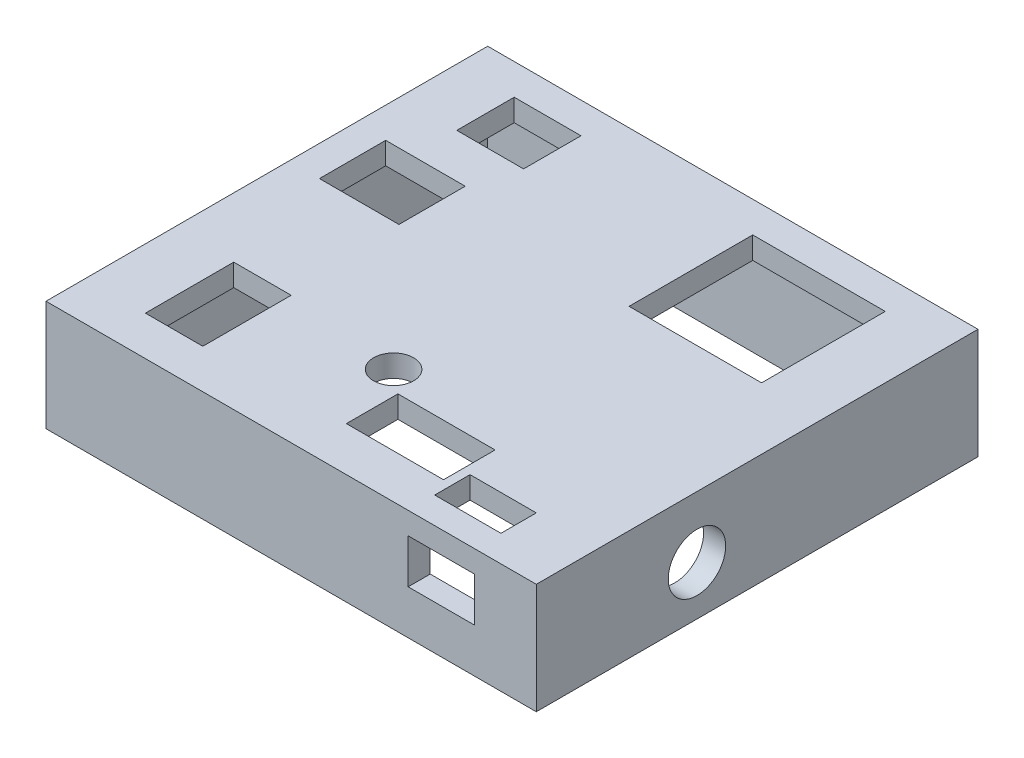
ISO-10303-21;
HEADER;
FILE_DESCRIPTION(('STEP AP214'),'2;1');
FILE_NAME('part.step','',(''),(''),'','','');
FILE_SCHEMA(('AUTOMOTIVE_DESIGN { 1 0 10303 214 1 1 1 1 }'));
ENDSEC;
DATA;
#1=APPLICATION_CONTEXT('core data for automotive mechanical design processes');
#2=APPLICATION_PROTOCOL_DEFINITION('international standard','automotive_design',2000,#1);
#3=PRODUCT_CONTEXT('',#1,'mechanical');
#4=PRODUCT('Part','Part','',(#3));
#5=PRODUCT_RELATED_PRODUCT_CATEGORY('part','',(#4));
#6=PRODUCT_DEFINITION_FORMATION('','',#4);
#7=PRODUCT_DEFINITION_CONTEXT('part definition',#1,'design');
#8=PRODUCT_DEFINITION('design','',#6,#7);
#9=PRODUCT_DEFINITION_SHAPE('','',#8);
#10=(LENGTH_UNIT() NAMED_UNIT(*) SI_UNIT(.MILLI.,.METRE.));
#11=(NAMED_UNIT(*) PLANE_ANGLE_UNIT() SI_UNIT($,.RADIAN.));
#12=(NAMED_UNIT(*) SI_UNIT($,.STERADIAN.) SOLID_ANGLE_UNIT());
#13=UNCERTAINTY_MEASURE_WITH_UNIT(LENGTH_MEASURE(1.E-05),#10,'distance_accuracy_value','');
#14=(GEOMETRIC_REPRESENTATION_CONTEXT(3) GLOBAL_UNCERTAINTY_ASSIGNED_CONTEXT((#13)) GLOBAL_UNIT_ASSIGNED_CONTEXT((#10,
#11,#12)) REPRESENTATION_CONTEXT('',''));
#15=CARTESIAN_POINT('',(0.,0.,0.));
#16=DIRECTION('',(0.,0.,1.));
#17=DIRECTION('',(1.,0.,0.));
#18=AXIS2_PLACEMENT_3D('',#15,#16,#17);
#19=CARTESIAN_POINT('',(0.,25.,0.));
#20=DIRECTION('',(0.,-1.,0.));
#21=DIRECTION('',(0.,0.,-1.));
#22=AXIS2_PLACEMENT_3D('',#19,#20,#21);
#23=PLANE('',#22);
#24=DIRECTION('',(0.,0.,-1.));
#25=VECTOR('',#24,1.);
#26=CARTESIAN_POINT('',(-0.848341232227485,25.,0.));
#27=LINE('',#26,#25);
#28=CARTESIAN_POINT('',(-0.848341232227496,25.,52.1303317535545));
#29=VERTEX_POINT('',#28);
#30=CARTESIAN_POINT('',(-0.848341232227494,25.,44.1303317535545));
#31=VERTEX_POINT('',#30);
#32=EDGE_CURVE('E467',#29,#31,#27,.T.);
#33=ORIENTED_EDGE('',*,*,#32,.F.);
#34=DIRECTION('',(-1.,0.,0.));
#35=VECTOR('',#34,1.);
#36=CARTESIAN_POINT('',(0.,25.,52.1303317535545));
#37=LINE('',#36,#35);
#38=CARTESIAN_POINT('',(-15.8483412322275,25.,52.1303317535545));
#39=VERTEX_POINT('',#38);
#40=EDGE_CURVE('E459',#29,#39,#37,.T.);
#41=ORIENTED_EDGE('',*,*,#40,.T.);
#42=DIRECTION('',(0.,0.,-1.));
#43=VECTOR('',#42,1.);
#44=CARTESIAN_POINT('',(-15.8483412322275,25.,0.));
#45=LINE('',#44,#43);
#46=CARTESIAN_POINT('',(-15.8483412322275,25.,44.1303317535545));
#47=VERTEX_POINT('',#46);
#48=EDGE_CURVE('E462',#39,#47,#45,.T.);
#49=ORIENTED_EDGE('',*,*,#48,.T.);
#50=DIRECTION('',(-1.,0.,0.));
#51=VECTOR('',#50,1.);
#52=CARTESIAN_POINT('',(0.,25.,44.1303317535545));
#53=LINE('',#52,#51);
#54=EDGE_CURVE('E465',#31,#47,#53,.T.);
#55=ORIENTED_EDGE('',*,*,#54,.F.);
#56=EDGE_LOOP('',(#33,#41,#49,#55));
#57=FACE_BOUND('',#56,.T.);
#58=DIRECTION('',(1.,0.,0.));
#59=VECTOR('',#58,1.);
#60=CARTESIAN_POINT('',(0.,25.,36.4578858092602));
#61=LINE('',#60,#59);
#62=CARTESIAN_POINT('',(-39.8483412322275,25.,36.4578858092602));
#63=VERTEX_POINT('',#62);
#64=CARTESIAN_POINT('',(-17.8483412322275,25.,36.4578858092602));
#65=VERTEX_POINT('',#64);
#66=EDGE_CURVE('E495',#63,#65,#61,.T.);
#67=ORIENTED_EDGE('',*,*,#66,.T.);
#68=DIRECTION('',(0.,0.,1.));
#69=VECTOR('',#68,1.);
#70=CARTESIAN_POINT('',(-17.8483412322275,25.,0.));
#71=LINE('',#70,#69);
#72=CARTESIAN_POINT('',(-17.8483412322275,25.,48.1303317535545));
#73=VERTEX_POINT('',#72);
#74=EDGE_CURVE('E498',#65,#73,#71,.T.);
#75=ORIENTED_EDGE('',*,*,#74,.T.);
#76=DIRECTION('',(-1.,0.,0.));
#77=VECTOR('',#76,1.);
#78=CARTESIAN_POINT('',(0.,25.,48.1303317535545));
#79=LINE('',#78,#77);
#80=CARTESIAN_POINT('',(-39.8483412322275,25.,48.1303317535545));
#81=VERTEX_POINT('',#80);
#82=EDGE_CURVE('E483',#73,#81,#79,.T.);
#83=ORIENTED_EDGE('',*,*,#82,.T.);
#84=DIRECTION('',(0.,0.,-1.));
#85=VECTOR('',#84,1.);
#86=CARTESIAN_POINT('',(-39.8483412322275,25.,0.));
#87=LINE('',#86,#85);
#88=EDGE_CURVE('E492',#81,#63,#87,.T.);
#89=ORIENTED_EDGE('',*,*,#88,.T.);
#90=EDGE_LOOP('',(#67,#75,#83,#89));
#91=FACE_BOUND('',#90,.T.);
#92=DIRECTION('',(1.,0.,0.));
#93=VECTOR('',#92,1.);
#94=CARTESIAN_POINT('',(-97.8483412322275,25.,-41.8696682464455));
#95=LINE('',#94,#93);
#96=CARTESIAN_POINT('',(-97.8483412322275,25.,-41.8696682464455));
#97=VERTEX_POINT('',#96);
#98=CARTESIAN_POINT('',(13.1516587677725,25.,-41.8696682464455));
#99=VERTEX_POINT('',#98);
#100=EDGE_CURVE('E534',#97,#99,#95,.T.);
#101=ORIENTED_EDGE('',*,*,#100,.F.);
#102=DIRECTION('',(0.,0.,1.));
#103=VECTOR('',#102,1.);
#104=CARTESIAN_POINT('',(-97.8483412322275,25.,-41.8696682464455));
#105=LINE('',#104,#103);
#106=CARTESIAN_POINT('',(-97.8483412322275,25.,58.1303317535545));
#107=VERTEX_POINT('',#106);
#108=EDGE_CURVE('E543',#97,#107,#105,.T.);
#109=ORIENTED_EDGE('',*,*,#108,.T.);
#110=DIRECTION('',(1.,0.,0.));
#111=VECTOR('',#110,1.);
#112=CARTESIAN_POINT('',(-97.8483412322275,25.,58.1303317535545));
#113=LINE('',#112,#111);
#114=CARTESIAN_POINT('',(13.1516587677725,25.,58.1303317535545));
#115=VERTEX_POINT('',#114);
#116=EDGE_CURVE('E541',#107,#115,#113,.T.);
#117=ORIENTED_EDGE('',*,*,#116,.T.);
#118=DIRECTION('',(0.,0.,1.));
#119=VECTOR('',#118,1.);
#120=CARTESIAN_POINT('',(13.1516587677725,25.,-41.8696682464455));
#121=LINE('',#120,#119);
#122=EDGE_CURVE('E537',#99,#115,#121,.T.);
#123=ORIENTED_EDGE('',*,*,#122,.F.);
#124=EDGE_LOOP('',(#101,#109,#117,#123));
#125=FACE_BOUND('',#124,.T.);
#126=DIRECTION('',(-1.,0.,0.));
#127=VECTOR('',#126,1.);
#128=CARTESIAN_POINT('',(0.,25.,3.13033175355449));
#129=LINE('',#128,#127);
#130=CARTESIAN_POINT('',(-72.9405315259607,25.,3.13033175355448));
#131=VERTEX_POINT('',#130);
#132=CARTESIAN_POINT('',(-90.9405315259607,25.,3.13033175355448));
#133=VERTEX_POINT('',#132);
#134=EDGE_CURVE('E432',#131,#133,#129,.T.);
#135=ORIENTED_EDGE('',*,*,#134,.T.);
#136=DIRECTION('',(0.,0.,-1.));
#137=VECTOR('',#136,1.);
#138=CARTESIAN_POINT('',(-90.9405315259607,25.,0.));
#139=LINE('',#138,#137);
#140=CARTESIAN_POINT('',(-90.9405315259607,25.,-11.8696682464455));
#141=VERTEX_POINT('',#140);
#142=EDGE_CURVE('E435',#133,#141,#139,.T.);
#143=ORIENTED_EDGE('',*,*,#142,.T.);
#144=DIRECTION('',(1.,0.,0.));
#145=VECTOR('',#144,1.);
#146=CARTESIAN_POINT('',(0.,25.,-11.8696682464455));
#147=LINE('',#146,#145);
#148=CARTESIAN_POINT('',(-72.9405315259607,25.,-11.8696682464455));
#149=VERTEX_POINT('',#148);
#150=EDGE_CURVE('E420',#141,#149,#147,.T.);
#151=ORIENTED_EDGE('',*,*,#150,.T.);
#152=DIRECTION('',(0.,0.,1.));
#153=VECTOR('',#152,1.);
#154=CARTESIAN_POINT('',(-72.9405315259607,25.,0.));
#155=LINE('',#154,#153);
#156=EDGE_CURVE('E429',#149,#131,#155,.T.);
#157=ORIENTED_EDGE('',*,*,#156,.T.);
#158=EDGE_LOOP('',(#135,#143,#151,#157));
#159=FACE_BOUND('',#158,.T.);
#160=DIRECTION('',(-1.,0.,0.));
#161=VECTOR('',#160,1.);
#162=CARTESIAN_POINT('',(0.,25.,-21.8696682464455));
#163=LINE('',#162,#161);
#164=CARTESIAN_POINT('',(-69.72707071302,25.,-21.8696682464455));
#165=VERTEX_POINT('',#164);
#166=CARTESIAN_POINT('',(-84.8483412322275,25.,-21.8696682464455));
#167=VERTEX_POINT('',#166);
#168=EDGE_CURVE('E400',#165,#167,#163,.T.);
#169=ORIENTED_EDGE('',*,*,#168,.T.);
#170=DIRECTION('',(0.,0.,-1.));
#171=VECTOR('',#170,1.);
#172=CARTESIAN_POINT('',(-84.8483412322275,25.,0.));
#173=LINE('',#172,#171);
#174=CARTESIAN_POINT('',(-84.8483412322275,25.,-34.8696682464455));
#175=VERTEX_POINT('',#174);
#176=EDGE_CURVE('E403',#167,#175,#173,.T.);
#177=ORIENTED_EDGE('',*,*,#176,.T.);
#178=DIRECTION('',(1.,0.,0.));
#179=VECTOR('',#178,1.);
#180=CARTESIAN_POINT('',(0.,25.,-34.8696682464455));
#181=LINE('',#180,#179);
#182=CARTESIAN_POINT('',(-69.72707071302,25.,-34.8696682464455));
#183=VERTEX_POINT('',#182);
#184=EDGE_CURVE('E388',#175,#183,#181,.T.);
#185=ORIENTED_EDGE('',*,*,#184,.T.);
#186=DIRECTION('',(0.,0.,1.));
#187=VECTOR('',#186,1.);
#188=CARTESIAN_POINT('',(-69.72707071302,25.,0.));
#189=LINE('',#188,#187);
#190=EDGE_CURVE('E397',#183,#165,#189,.T.);
#191=ORIENTED_EDGE('',*,*,#190,.T.);
#192=EDGE_LOOP('',(#169,#177,#185,#191));
#193=FACE_BOUND('',#192,.T.);
#194=DIRECTION('',(1.,0.,0.));
#195=VECTOR('',#194,1.);
#196=CARTESIAN_POINT('',(0.,25.,-34.8696682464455));
#197=LINE('',#196,#195);
#198=CARTESIAN_POINT('',(-30.8483412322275,25.,-34.8696682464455));
#199=VERTEX_POINT('',#198);
#200=CARTESIAN_POINT('',(-0.848341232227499,25.,-34.8696682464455));
#201=VERTEX_POINT('',#200);
#202=EDGE_CURVE('E368',#199,#201,#197,.T.);
#203=ORIENTED_EDGE('',*,*,#202,.T.);
#204=DIRECTION('',(0.,0.,1.));
#205=VECTOR('',#204,1.);
#206=CARTESIAN_POINT('',(-0.848341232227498,25.,0.));
#207=LINE('',#206,#205);
#208=CARTESIAN_POINT('',(-0.848341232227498,25.,-6.86966824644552));
#209=VERTEX_POINT('',#208);
#210=EDGE_CURVE('E371',#201,#209,#207,.T.);
#211=ORIENTED_EDGE('',*,*,#210,.T.);
#212=DIRECTION('',(-1.,0.,0.));
#213=VECTOR('',#212,1.);
#214=CARTESIAN_POINT('',(0.,25.,-6.86966824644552));
#215=LINE('',#214,#213);
#216=CARTESIAN_POINT('',(-30.8483412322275,25.,-6.86966824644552));
#217=VERTEX_POINT('',#216);
#218=EDGE_CURVE('E356',#209,#217,#215,.T.);
#219=ORIENTED_EDGE('',*,*,#218,.T.);
#220=DIRECTION('',(0.,0.,-1.));
#221=VECTOR('',#220,1.);
#222=CARTESIAN_POINT('',(-30.8483412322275,25.,0.));
#223=LINE('',#222,#221);
#224=EDGE_CURVE('E365',#217,#199,#223,.T.);
#225=ORIENTED_EDGE('',*,*,#224,.T.);
#226=EDGE_LOOP('',(#203,#211,#219,#225));
#227=FACE_BOUND('',#226,.T.);
#228=CARTESIAN_POINT('',(-45.1557478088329,25.,32.1303317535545));
#229=DIRECTION('',(0.,-1.,0.));
#230=DIRECTION('',(0.,0.,-1.));
#231=AXIS2_PLACEMENT_3D('',#228,#229,#230);
#232=CIRCLE('',#231,4.53368400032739);
#233=CARTESIAN_POINT('',(-45.1557478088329,25.,27.5966477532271));
#234=VERTEX_POINT('',#233);
#235=EDGE_CURVE('E339',#234,#234,#232,.T.);
#236=ORIENTED_EDGE('',*,*,#235,.T.);
#237=EDGE_LOOP('',(#236));
#238=FACE_BOUND('',#237,.T.);
#239=DIRECTION('',(1.,0.,0.));
#240=VECTOR('',#239,1.);
#241=CARTESIAN_POINT('',(0.,25.,49.2145306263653));
#242=LINE('',#241,#240);
#243=CARTESIAN_POINT('',(-84.2612879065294,25.,49.2145306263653));
#244=VERTEX_POINT('',#243);
#245=CARTESIAN_POINT('',(-71.2612879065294,25.,49.2145306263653));
#246=VERTEX_POINT('',#245);
#247=EDGE_CURVE('E334',#244,#246,#242,.T.);
#248=ORIENTED_EDGE('',*,*,#247,.F.);
#249=DIRECTION('',(0.,0.,-1.));
#250=VECTOR('',#249,1.);
#251=CARTESIAN_POINT('',(-84.2612879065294,25.,0.));
#252=LINE('',#251,#250);
#253=CARTESIAN_POINT('',(-84.2612879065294,25.,29.2145306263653));
#254=VERTEX_POINT('',#253);
#255=EDGE_CURVE('E326',#244,#254,#252,.T.);
#256=ORIENTED_EDGE('',*,*,#255,.T.);
#257=DIRECTION('',(1.,0.,0.));
#258=VECTOR('',#257,1.);
#259=CARTESIAN_POINT('',(0.,25.,29.2145306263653));
#260=LINE('',#259,#258);
#261=CARTESIAN_POINT('',(-71.2612879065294,25.,29.2145306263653));
#262=VERTEX_POINT('',#261);
#263=EDGE_CURVE('E329',#254,#262,#260,.T.);
#264=ORIENTED_EDGE('',*,*,#263,.T.);
#265=DIRECTION('',(0.,0.,-1.));
#266=VECTOR('',#265,1.);
#267=CARTESIAN_POINT('',(-71.2612879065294,25.,0.));
#268=LINE('',#267,#266);
#269=EDGE_CURVE('E332',#246,#262,#268,.T.);
#270=ORIENTED_EDGE('',*,*,#269,.F.);
#271=EDGE_LOOP('',(#248,#256,#264,#270));
#272=FACE_BOUND('',#271,.T.);
#273=ADVANCED_FACE('F33',(#57,#91,#125,#159,#193,#227,#238,#272),#23,.F.);
#274=CARTESIAN_POINT('',(0.,20.,0.));
#275=DIRECTION('',(0.,-1.,0.));
#276=DIRECTION('',(0.,0.,-1.));
#277=AXIS2_PLACEMENT_3D('',#274,#275,#276);
#278=PLANE('',#277);
#279=CARTESIAN_POINT('',(-45.1557478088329,20.,32.1303317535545));
#280=DIRECTION('',(0.,-1.,0.));
#281=DIRECTION('',(0.,0.,-1.));
#282=AXIS2_PLACEMENT_3D('',#279,#280,#281);
#283=CIRCLE('',#282,4.53368400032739);
#284=CARTESIAN_POINT('',(-45.1557478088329,20.,27.5966477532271));
#285=VERTEX_POINT('',#284);
#286=EDGE_CURVE('E336',#285,#285,#283,.T.);
#287=ORIENTED_EDGE('',*,*,#286,.F.);
#288=EDGE_LOOP('',(#287));
#289=FACE_BOUND('',#288,.T.);
#290=DIRECTION('',(0.,0.,1.));
#291=VECTOR('',#290,1.);
#292=CARTESIAN_POINT('',(-0.848341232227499,20.,-34.8696682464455));
#293=LINE('',#292,#291);
#294=CARTESIAN_POINT('',(-0.848341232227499,20.,-34.8696682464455));
#295=VERTEX_POINT('',#294);
#296=CARTESIAN_POINT('',(-0.848341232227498,20.,-6.86966824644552));
#297=VERTEX_POINT('',#296);
#298=EDGE_CURVE('E342',#295,#297,#293,.T.);
#299=ORIENTED_EDGE('',*,*,#298,.F.);
#300=DIRECTION('',(1.,0.,0.));
#301=VECTOR('',#300,1.);
#302=CARTESIAN_POINT('',(-0.848341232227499,20.,-34.8696682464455));
#303=LINE('',#302,#301);
#304=CARTESIAN_POINT('',(-30.8483412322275,20.,-34.8696682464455));
#305=VERTEX_POINT('',#304);
#306=EDGE_CURVE('E350',#305,#295,#303,.T.);
#307=ORIENTED_EDGE('',*,*,#306,.F.);
#308=DIRECTION('',(0.,0.,-1.));
#309=VECTOR('',#308,1.);
#310=CARTESIAN_POINT('',(-30.8483412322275,20.,-34.8696682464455));
#311=LINE('',#310,#309);
#312=CARTESIAN_POINT('',(-30.8483412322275,20.,-6.86966824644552));
#313=VERTEX_POINT('',#312);
#314=EDGE_CURVE('E347',#313,#305,#311,.T.);
#315=ORIENTED_EDGE('',*,*,#314,.F.);
#316=DIRECTION('',(-1.,0.,0.));
#317=VECTOR('',#316,1.);
#318=CARTESIAN_POINT('',(-0.848341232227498,20.,-6.86966824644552));
#319=LINE('',#318,#317);
#320=EDGE_CURVE('E344',#297,#313,#319,.T.);
#321=ORIENTED_EDGE('',*,*,#320,.F.);
#322=EDGE_LOOP('',(#299,#307,#315,#321));
#323=FACE_BOUND('',#322,.T.);
#324=DIRECTION('',(0.,0.,-1.));
#325=VECTOR('',#324,1.);
#326=CARTESIAN_POINT('',(-84.8483412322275,20.,-34.8696682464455));
#327=LINE('',#326,#325);
#328=CARTESIAN_POINT('',(-84.8483412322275,20.,-21.8696682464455));
#329=VERTEX_POINT('',#328);
#330=CARTESIAN_POINT('',(-84.8483412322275,20.,-34.8696682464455));
#331=VERTEX_POINT('',#330);
#332=EDGE_CURVE('E374',#329,#331,#327,.T.);
#333=ORIENTED_EDGE('',*,*,#332,.F.);
#334=DIRECTION('',(-1.,0.,0.));
#335=VECTOR('',#334,1.);
#336=CARTESIAN_POINT('',(-84.8483412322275,20.,-21.8696682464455));
#337=LINE('',#336,#335);
#338=CARTESIAN_POINT('',(-69.72707071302,20.,-21.8696682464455));
#339=VERTEX_POINT('',#338);
#340=EDGE_CURVE('E382',#339,#329,#337,.T.);
#341=ORIENTED_EDGE('',*,*,#340,.F.);
#342=DIRECTION('',(0.,0.,1.));
#343=VECTOR('',#342,1.);
#344=CARTESIAN_POINT('',(-69.72707071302,20.,-34.8696682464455));
#345=LINE('',#344,#343);
#346=CARTESIAN_POINT('',(-69.72707071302,20.,-34.8696682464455));
#347=VERTEX_POINT('',#346);
#348=EDGE_CURVE('E379',#347,#339,#345,.T.);
#349=ORIENTED_EDGE('',*,*,#348,.F.);
#350=DIRECTION('',(1.,0.,0.));
#351=VECTOR('',#350,1.);
#352=CARTESIAN_POINT('',(-84.8483412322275,20.,-34.8696682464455));
#353=LINE('',#352,#351);
#354=EDGE_CURVE('E376',#331,#347,#353,.T.);
#355=ORIENTED_EDGE('',*,*,#354,.F.);
#356=EDGE_LOOP('',(#333,#341,#349,#355));
#357=FACE_BOUND('',#356,.T.);
#358=DIRECTION('',(0.,0.,-1.));
#359=VECTOR('',#358,1.);
#360=CARTESIAN_POINT('',(-90.9405315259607,20.,-11.8696682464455));
#361=LINE('',#360,#359);
#362=CARTESIAN_POINT('',(-90.9405315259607,20.,3.13033175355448));
#363=VERTEX_POINT('',#362);
#364=CARTESIAN_POINT('',(-90.9405315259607,20.,-11.8696682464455));
#365=VERTEX_POINT('',#364);
#366=EDGE_CURVE('E406',#363,#365,#361,.T.);
#367=ORIENTED_EDGE('',*,*,#366,.F.);
#368=DIRECTION('',(-1.,0.,0.));
#369=VECTOR('',#368,1.);
#370=CARTESIAN_POINT('',(-90.9405315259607,20.,3.13033175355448));
#371=LINE('',#370,#369);
#372=CARTESIAN_POINT('',(-72.9405315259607,20.,3.13033175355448));
#373=VERTEX_POINT('',#372);
#374=EDGE_CURVE('E414',#373,#363,#371,.T.);
#375=ORIENTED_EDGE('',*,*,#374,.F.);
#376=DIRECTION('',(0.,0.,1.));
#377=VECTOR('',#376,1.);
#378=CARTESIAN_POINT('',(-72.9405315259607,20.,-11.8696682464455));
#379=LINE('',#378,#377);
#380=CARTESIAN_POINT('',(-72.9405315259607,20.,-11.8696682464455));
#381=VERTEX_POINT('',#380);
#382=EDGE_CURVE('E411',#381,#373,#379,.T.);
#383=ORIENTED_EDGE('',*,*,#382,.F.);
#384=DIRECTION('',(1.,0.,0.));
#385=VECTOR('',#384,1.);
#386=CARTESIAN_POINT('',(-90.9405315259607,20.,-11.8696682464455));
#387=LINE('',#386,#385);
#388=EDGE_CURVE('E408',#365,#381,#387,.T.);
#389=ORIENTED_EDGE('',*,*,#388,.F.);
#390=EDGE_LOOP('',(#367,#375,#383,#389));
#391=FACE_BOUND('',#390,.T.);
#392=DIRECTION('',(0.,0.,1.));
#393=VECTOR('',#392,1.);
#394=CARTESIAN_POINT('',(-17.8483412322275,20.,48.1303317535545));
#395=LINE('',#394,#393);
#396=CARTESIAN_POINT('',(-17.8483412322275,20.,36.4578858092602));
#397=VERTEX_POINT('',#396);
#398=CARTESIAN_POINT('',(-17.8483412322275,20.,48.1303317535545));
#399=VERTEX_POINT('',#398);
#400=EDGE_CURVE('E469',#397,#399,#395,.T.);
#401=ORIENTED_EDGE('',*,*,#400,.F.);
#402=DIRECTION('',(1.,0.,0.));
#403=VECTOR('',#402,1.);
#404=CARTESIAN_POINT('',(-17.8483412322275,20.,36.4578858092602));
#405=LINE('',#404,#403);
#406=CARTESIAN_POINT('',(-39.8483412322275,20.,36.4578858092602));
#407=VERTEX_POINT('',#406);
#408=EDGE_CURVE('E477',#407,#397,#405,.T.);
#409=ORIENTED_EDGE('',*,*,#408,.F.);
#410=DIRECTION('',(0.,0.,-1.));
#411=VECTOR('',#410,1.);
#412=CARTESIAN_POINT('',(-39.8483412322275,20.,48.1303317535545));
#413=LINE('',#412,#411);
#414=CARTESIAN_POINT('',(-39.8483412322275,20.,48.1303317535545));
#415=VERTEX_POINT('',#414);
#416=EDGE_CURVE('E474',#415,#407,#413,.T.);
#417=ORIENTED_EDGE('',*,*,#416,.F.);
#418=DIRECTION('',(-1.,0.,0.));
#419=VECTOR('',#418,1.);
#420=CARTESIAN_POINT('',(-17.8483412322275,20.,48.1303317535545));
#421=LINE('',#420,#419);
#422=EDGE_CURVE('E471',#399,#415,#421,.T.);
#423=ORIENTED_EDGE('',*,*,#422,.F.);
#424=EDGE_LOOP('',(#401,#409,#417,#423));
#425=FACE_BOUND('',#424,.T.);
#426=DIRECTION('',(0.,0.,-1.));
#427=VECTOR('',#426,1.);
#428=CARTESIAN_POINT('',(-92.8483412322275,20.,53.1303317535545));
#429=LINE('',#428,#427);
#430=CARTESIAN_POINT('',(-92.8483412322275,20.,53.1303317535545));
#431=VERTEX_POINT('',#430);
#432=CARTESIAN_POINT('',(-92.8483412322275,20.,-36.8696682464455));
#433=VERTEX_POINT('',#432);
#434=EDGE_CURVE('E502',#431,#433,#429,.T.);
#435=ORIENTED_EDGE('',*,*,#434,.T.);
#436=DIRECTION('',(1.,0.,0.));
#437=VECTOR('',#436,1.);
#438=CARTESIAN_POINT('',(-92.8483412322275,20.,-36.8696682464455));
#439=LINE('',#438,#437);
#440=CARTESIAN_POINT('',(8.1516587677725,20.,-36.8696682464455));
#441=VERTEX_POINT('',#440);
#442=EDGE_CURVE('E505',#433,#441,#439,.T.);
#443=ORIENTED_EDGE('',*,*,#442,.T.);
#444=DIRECTION('',(0.,0.,1.));
#445=VECTOR('',#444,1.);
#446=CARTESIAN_POINT('',(8.15165876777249,20.,53.1303317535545));
#447=LINE('',#446,#445);
#448=CARTESIAN_POINT('',(8.15165876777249,20.,53.1303317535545));
#449=VERTEX_POINT('',#448);
#450=EDGE_CURVE('E509',#441,#449,#447,.T.);
#451=ORIENTED_EDGE('',*,*,#450,.T.);
#452=DIRECTION('',(-1.,0.,0.));
#453=VECTOR('',#452,1.);
#454=CARTESIAN_POINT('',(-92.8483412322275,20.,53.1303317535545));
#455=LINE('',#454,#453);
#456=CARTESIAN_POINT('',(-0.834145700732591,20.,53.1303317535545));
#457=VERTEX_POINT('',#456);
#458=EDGE_CURVE('E512',#449,#457,#455,.T.);
#459=ORIENTED_EDGE('',*,*,#458,.T.);
#460=DIRECTION('',(0.,0.,-1.));
#461=VECTOR('',#460,1.);
#462=CARTESIAN_POINT('',(-0.834145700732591,20.,73.1303317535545));
#463=LINE('',#462,#461);
#464=CARTESIAN_POINT('',(-0.834145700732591,20.,58.1303317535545));
#465=VERTEX_POINT('',#464);
#466=EDGE_CURVE('E290',#465,#457,#463,.T.);
#467=ORIENTED_EDGE('',*,*,#466,.F.);
#468=DIRECTION('',(1.,0.,0.));
#469=VECTOR('',#468,1.);
#470=CARTESIAN_POINT('',(-97.8483412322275,20.,58.1303317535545));
#471=LINE('',#470,#469);
#472=CARTESIAN_POINT('',(-15.8568874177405,20.,58.1303317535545));
#473=VERTEX_POINT('',#472);
#474=EDGE_CURVE('E296',#473,#465,#471,.T.);
#475=ORIENTED_EDGE('',*,*,#474,.F.);
#476=DIRECTION('',(0.,0.,-1.));
#477=VECTOR('',#476,1.);
#478=CARTESIAN_POINT('',(-15.8568874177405,20.,73.1303317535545));
#479=LINE('',#478,#477);
#480=CARTESIAN_POINT('',(-15.8568874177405,20.,53.1303317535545));
#481=VERTEX_POINT('',#480);
#482=EDGE_CURVE('E275',#473,#481,#479,.T.);
#483=ORIENTED_EDGE('',*,*,#482,.T.);
#484=EDGE_CURVE('E285',#481,#431,#455,.T.);
#485=ORIENTED_EDGE('',*,*,#484,.T.);
#486=EDGE_LOOP('',(#435,#443,#451,#459,#467,#475,#483,#485));
#487=FACE_BOUND('',#486,.T.);
#488=DIRECTION('',(-1.,0.,0.));
#489=VECTOR('',#488,1.);
#490=CARTESIAN_POINT('',(-0.848341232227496,20.,52.1303317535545));
#491=LINE('',#490,#489);
#492=CARTESIAN_POINT('',(-0.848341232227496,20.,52.1303317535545));
#493=VERTEX_POINT('',#492);
#494=CARTESIAN_POINT('',(-15.8483412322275,20.,52.1303317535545));
#495=VERTEX_POINT('',#494);
#496=EDGE_CURVE('E447',#493,#495,#491,.T.);
#497=ORIENTED_EDGE('',*,*,#496,.F.);
#498=DIRECTION('',(0.,0.,-1.));
#499=VECTOR('',#498,1.);
#500=CARTESIAN_POINT('',(-0.848341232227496,20.,52.1303317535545));
#501=LINE('',#500,#499);
#502=CARTESIAN_POINT('',(-0.848341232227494,20.,44.1303317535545));
#503=VERTEX_POINT('',#502);
#504=EDGE_CURVE('E438',#493,#503,#501,.T.);
#505=ORIENTED_EDGE('',*,*,#504,.T.);
#506=DIRECTION('',(-1.,0.,0.));
#507=VECTOR('',#506,1.);
#508=CARTESIAN_POINT('',(-0.848341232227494,20.,44.1303317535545));
#509=LINE('',#508,#507);
#510=CARTESIAN_POINT('',(-15.8483412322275,20.,44.1303317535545));
#511=VERTEX_POINT('',#510);
#512=EDGE_CURVE('E441',#503,#511,#509,.T.);
#513=ORIENTED_EDGE('',*,*,#512,.T.);
#514=DIRECTION('',(0.,0.,-1.));
#515=VECTOR('',#514,1.);
#516=CARTESIAN_POINT('',(-15.8483412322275,20.,52.1303317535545));
#517=LINE('',#516,#515);
#518=EDGE_CURVE('E444',#495,#511,#517,.T.);
#519=ORIENTED_EDGE('',*,*,#518,.F.);
#520=EDGE_LOOP('',(#497,#505,#513,#519));
#521=FACE_BOUND('',#520,.T.);
#522=DIRECTION('',(0.,0.,-1.));
#523=VECTOR('',#522,1.);
#524=CARTESIAN_POINT('',(-84.2612879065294,20.,49.2145306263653));
#525=LINE('',#524,#523);
#526=CARTESIAN_POINT('',(-84.2612879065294,20.,49.2145306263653));
#527=VERTEX_POINT('',#526);
#528=CARTESIAN_POINT('',(-84.2612879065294,20.,29.2145306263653));
#529=VERTEX_POINT('',#528);
#530=EDGE_CURVE('E314',#527,#529,#525,.T.);
#531=ORIENTED_EDGE('',*,*,#530,.F.);
#532=DIRECTION('',(1.,0.,0.));
#533=VECTOR('',#532,1.);
#534=CARTESIAN_POINT('',(-84.2612879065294,20.,49.2145306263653));
#535=LINE('',#534,#533);
#536=CARTESIAN_POINT('',(-71.2612879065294,20.,49.2145306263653));
#537=VERTEX_POINT('',#536);
#538=EDGE_CURVE('E305',#527,#537,#535,.T.);
#539=ORIENTED_EDGE('',*,*,#538,.T.);
#540=DIRECTION('',(0.,0.,-1.));
#541=VECTOR('',#540,1.);
#542=CARTESIAN_POINT('',(-71.2612879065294,20.,49.2145306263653));
#543=LINE('',#542,#541);
#544=CARTESIAN_POINT('',(-71.2612879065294,20.,29.2145306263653));
#545=VERTEX_POINT('',#544);
#546=EDGE_CURVE('E308',#537,#545,#543,.T.);
#547=ORIENTED_EDGE('',*,*,#546,.T.);
#548=DIRECTION('',(1.,0.,0.));
#549=VECTOR('',#548,1.);
#550=CARTESIAN_POINT('',(-84.2612879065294,20.,29.2145306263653));
#551=LINE('',#550,#549);
#552=EDGE_CURVE('E311',#529,#545,#551,.T.);
#553=ORIENTED_EDGE('',*,*,#552,.F.);
#554=EDGE_LOOP('',(#531,#539,#547,#553));
#555=FACE_BOUND('',#554,.T.);
#556=ADVANCED_FACE('F580',(#289,#323,#357,#391,#425,#487,#521,#555),#278,.T.);
#557=CARTESIAN_POINT('',(-97.8483412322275,25.,-41.8696682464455));
#558=DIRECTION('',(0.,0.,-1.));
#559=DIRECTION('',(-1.,0.,0.));
#560=AXIS2_PLACEMENT_3D('',#557,#558,#559);
#561=PLANE('',#560);
#562=DIRECTION('',(1.,0.,0.));
#563=VECTOR('',#562,1.);
#564=CARTESIAN_POINT('',(-97.8483412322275,0.,-41.8696682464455));
#565=LINE('',#564,#563);
#566=CARTESIAN_POINT('',(-97.8483412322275,0.,-41.8696682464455));
#567=VERTEX_POINT('',#566);
#568=CARTESIAN_POINT('',(13.1516587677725,0.,-41.8696682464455));
#569=VERTEX_POINT('',#568);
#570=EDGE_CURVE('E527',#567,#569,#565,.T.);
#571=ORIENTED_EDGE('',*,*,#570,.F.);
#572=DIRECTION('',(0.,-1.,0.));
#573=VECTOR('',#572,1.);
#574=CARTESIAN_POINT('',(-97.8483412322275,25.,-41.8696682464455));
#575=LINE('',#574,#573);
#576=EDGE_CURVE('E11',#97,#567,#575,.T.);
#577=ORIENTED_EDGE('',*,*,#576,.F.);
#578=ORIENTED_EDGE('',*,*,#100,.T.);
#579=DIRECTION('',(0.,-1.,0.));
#580=VECTOR('',#579,1.);
#581=CARTESIAN_POINT('',(13.1516587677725,25.,-41.8696682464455));
#582=LINE('',#581,#580);
#583=EDGE_CURVE('E545',#99,#569,#582,.T.);
#584=ORIENTED_EDGE('',*,*,#583,.T.);
#585=EDGE_LOOP('',(#571,#577,#578,#584));
#586=FACE_BOUND('',#585,.T.);
#587=ADVANCED_FACE('F35',(#586),#561,.T.);
#588=CARTESIAN_POINT('',(-97.8483412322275,25.,-41.8696682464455));
#589=DIRECTION('',(1.,0.,0.));
#590=DIRECTION('',(0.,0.,-1.));
#591=AXIS2_PLACEMENT_3D('',#588,#589,#590);
#592=PLANE('',#591);
#593=DIRECTION('',(0.,0.,1.));
#594=VECTOR('',#593,1.);
#595=CARTESIAN_POINT('',(-97.8483412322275,0.,-41.8696682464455));
#596=LINE('',#595,#594);
#597=CARTESIAN_POINT('',(-97.8483412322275,0.,58.1303317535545));
#598=VERTEX_POINT('',#597);
#599=EDGE_CURVE('E538',#567,#598,#596,.T.);
#600=ORIENTED_EDGE('',*,*,#599,.T.);
#601=DIRECTION('',(0.,-1.,0.));
#602=VECTOR('',#601,1.);
#603=CARTESIAN_POINT('',(-97.8483412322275,25.,58.1303317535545));
#604=LINE('',#603,#602);
#605=EDGE_CURVE('E42',#107,#598,#604,.T.);
#606=ORIENTED_EDGE('',*,*,#605,.F.);
#607=ORIENTED_EDGE('',*,*,#108,.F.);
#608=ORIENTED_EDGE('',*,*,#576,.T.);
#609=EDGE_LOOP('',(#600,#606,#607,#608));
#610=FACE_BOUND('',#609,.T.);
#611=ADVANCED_FACE('F572',(#610),#592,.F.);
#612=CARTESIAN_POINT('',(-97.8483412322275,25.,58.1303317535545));
#613=DIRECTION('',(0.,0.,-1.));
#614=DIRECTION('',(-1.,0.,0.));
#615=AXIS2_PLACEMENT_3D('',#612,#613,#614);
#616=PLANE('',#615);
#617=ORIENTED_EDGE('',*,*,#474,.T.);
#618=DIRECTION('',(0.,-1.,0.));
#619=VECTOR('',#618,1.);
#620=CARTESIAN_POINT('',(-0.834145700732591,25.,58.1303317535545));
#621=LINE('',#620,#619);
#622=CARTESIAN_POINT('',(-0.834145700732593,10.,58.1303317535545));
#623=VERTEX_POINT('',#622);
#624=EDGE_CURVE('E299',#465,#623,#621,.T.);
#625=ORIENTED_EDGE('',*,*,#624,.T.);
#626=DIRECTION('',(-1.,0.,0.));
#627=VECTOR('',#626,1.);
#628=CARTESIAN_POINT('',(-97.8483412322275,10.,58.1303317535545));
#629=LINE('',#628,#627);
#630=CARTESIAN_POINT('',(-15.8568874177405,10.,58.1303317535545));
#631=VERTEX_POINT('',#630);
#632=EDGE_CURVE('E292',#623,#631,#629,.T.);
#633=ORIENTED_EDGE('',*,*,#632,.T.);
#634=DIRECTION('',(0.,1.,0.));
#635=VECTOR('',#634,1.);
#636=CARTESIAN_POINT('',(-15.8568874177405,25.,58.1303317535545));
#637=LINE('',#636,#635);
#638=EDGE_CURVE('E273',#631,#473,#637,.T.);
#639=ORIENTED_EDGE('',*,*,#638,.T.);
#640=EDGE_LOOP('',(#617,#625,#633,#639));
#641=FACE_BOUND('',#640,.T.);
#642=DIRECTION('',(1.,0.,0.));
#643=VECTOR('',#642,1.);
#644=CARTESIAN_POINT('',(-97.8483412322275,0.,58.1303317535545));
#645=LINE('',#644,#643);
#646=CARTESIAN_POINT('',(13.1516587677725,0.,58.1303317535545));
#647=VERTEX_POINT('',#646);
#648=EDGE_CURVE('E551',#598,#647,#645,.T.);
#649=ORIENTED_EDGE('',*,*,#648,.T.);
#650=DIRECTION('',(0.,-1.,0.));
#651=VECTOR('',#650,1.);
#652=CARTESIAN_POINT('',(13.1516587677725,25.,58.1303317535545));
#653=LINE('',#652,#651);
#654=EDGE_CURVE('E557',#115,#647,#653,.T.);
#655=ORIENTED_EDGE('',*,*,#654,.F.);
#656=ORIENTED_EDGE('',*,*,#116,.F.);
#657=ORIENTED_EDGE('',*,*,#605,.T.);
#658=EDGE_LOOP('',(#649,#655,#656,#657));
#659=FACE_BOUND('',#658,.T.);
#660=ADVANCED_FACE('F576',(#641,#659),#616,.F.);
#661=CARTESIAN_POINT('',(13.1516587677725,25.,-41.8696682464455));
#662=DIRECTION('',(1.,0.,0.));
#663=DIRECTION('',(0.,0.,-1.));
#664=AXIS2_PLACEMENT_3D('',#661,#662,#663);
#665=PLANE('',#664);
#666=CARTESIAN_POINT('',(13.1516587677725,11.1014963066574,21.7583455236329));
#667=DIRECTION('',(1.,0.,0.));
#668=DIRECTION('',(0.,0.,-1.));
#669=AXIS2_PLACEMENT_3D('',#666,#667,#668);
#670=CIRCLE('',#669,6.5);
#671=CARTESIAN_POINT('',(13.1516587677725,11.1014963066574,15.2583455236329));
#672=VERTEX_POINT('',#671);
#673=EDGE_CURVE('E302',#672,#672,#670,.T.);
#674=ORIENTED_EDGE('',*,*,#673,.F.);
#675=EDGE_LOOP('',(#674));
#676=FACE_BOUND('',#675,.T.);
#677=DIRECTION('',(0.,0.,1.));
#678=VECTOR('',#677,1.);
#679=CARTESIAN_POINT('',(13.1516587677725,0.,-41.8696682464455));
#680=LINE('',#679,#678);
#681=EDGE_CURVE('E548',#569,#647,#680,.T.);
#682=ORIENTED_EDGE('',*,*,#681,.F.);
#683=ORIENTED_EDGE('',*,*,#583,.F.);
#684=ORIENTED_EDGE('',*,*,#122,.T.);
#685=ORIENTED_EDGE('',*,*,#654,.T.);
#686=EDGE_LOOP('',(#682,#683,#684,#685));
#687=FACE_BOUND('',#686,.T.);
#688=ADVANCED_FACE('F564',(#676,#687),#665,.T.);
#689=CARTESIAN_POINT('',(0.,0.,0.));
#690=DIRECTION('',(0.,-1.,0.));
#691=DIRECTION('',(0.,0.,-1.));
#692=AXIS2_PLACEMENT_3D('',#689,#690,#691);
#693=PLANE('',#692);
#694=DIRECTION('',(0.,0.,-1.));
#695=VECTOR('',#694,1.);
#696=CARTESIAN_POINT('',(-92.8483412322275,0.,53.1303317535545));
#697=LINE('',#696,#695);
#698=CARTESIAN_POINT('',(-92.8483412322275,0.,53.1303317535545));
#699=VERTEX_POINT('',#698);
#700=CARTESIAN_POINT('',(-92.8483412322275,0.,-36.8696682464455));
#701=VERTEX_POINT('',#700);
#702=EDGE_CURVE('E501',#699,#701,#697,.T.);
#703=ORIENTED_EDGE('',*,*,#702,.F.);
#704=DIRECTION('',(-1.,0.,0.));
#705=VECTOR('',#704,1.);
#706=CARTESIAN_POINT('',(-92.8483412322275,0.,53.1303317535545));
#707=LINE('',#706,#705);
#708=CARTESIAN_POINT('',(8.15165876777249,0.,53.1303317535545));
#709=VERTEX_POINT('',#708);
#710=EDGE_CURVE('E506',#709,#699,#707,.T.);
#711=ORIENTED_EDGE('',*,*,#710,.F.);
#712=DIRECTION('',(0.,0.,1.));
#713=VECTOR('',#712,1.);
#714=CARTESIAN_POINT('',(8.15165876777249,0.,53.1303317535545));
#715=LINE('',#714,#713);
#716=CARTESIAN_POINT('',(8.1516587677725,0.,-36.8696682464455));
#717=VERTEX_POINT('',#716);
#718=EDGE_CURVE('E520',#717,#709,#715,.T.);
#719=ORIENTED_EDGE('',*,*,#718,.F.);
#720=DIRECTION('',(1.,0.,0.));
#721=VECTOR('',#720,1.);
#722=CARTESIAN_POINT('',(-92.8483412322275,0.,-36.8696682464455));
#723=LINE('',#722,#721);
#724=EDGE_CURVE('E517',#701,#717,#723,.T.);
#725=ORIENTED_EDGE('',*,*,#724,.F.);
#726=EDGE_LOOP('',(#703,#711,#719,#725));
#727=FACE_BOUND('',#726,.T.);
#728=ORIENTED_EDGE('',*,*,#570,.T.);
#729=ORIENTED_EDGE('',*,*,#681,.T.);
#730=ORIENTED_EDGE('',*,*,#648,.F.);
#731=ORIENTED_EDGE('',*,*,#599,.F.);
#732=EDGE_LOOP('',(#728,#729,#730,#731));
#733=FACE_BOUND('',#732,.T.);
#734=ADVANCED_FACE('F569',(#727,#733),#693,.T.);
#735=CARTESIAN_POINT('',(-92.8483412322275,20.,53.1303317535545));
#736=DIRECTION('',(-1.,0.,0.));
#737=DIRECTION('',(0.,0.,1.));
#738=AXIS2_PLACEMENT_3D('',#735,#736,#737);
#739=PLANE('',#738);
#740=ORIENTED_EDGE('',*,*,#702,.T.);
#741=DIRECTION('',(0.,-1.,0.));
#742=VECTOR('',#741,1.);
#743=CARTESIAN_POINT('',(-92.8483412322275,20.,-36.8696682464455));
#744=LINE('',#743,#742);
#745=EDGE_CURVE('E515',#433,#701,#744,.T.);
#746=ORIENTED_EDGE('',*,*,#745,.F.);
#747=ORIENTED_EDGE('',*,*,#434,.F.);
#748=DIRECTION('',(0.,-1.,0.));
#749=VECTOR('',#748,1.);
#750=CARTESIAN_POINT('',(-92.8483412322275,20.,53.1303317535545));
#751=LINE('',#750,#749);
#752=EDGE_CURVE('E525',#431,#699,#751,.T.);
#753=ORIENTED_EDGE('',*,*,#752,.T.);
#754=EDGE_LOOP('',(#740,#746,#747,#753));
#755=FACE_BOUND('',#754,.T.);
#756=ADVANCED_FACE('F710',(#755),#739,.F.);
#757=CARTESIAN_POINT('',(-92.8483412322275,20.,53.1303317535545));
#758=DIRECTION('',(0.,0.,1.));
#759=DIRECTION('',(1.,0.,0.));
#760=AXIS2_PLACEMENT_3D('',#757,#758,#759);
#761=PLANE('',#760);
#762=DIRECTION('',(-1.,0.,0.));
#763=VECTOR('',#762,1.);
#764=CARTESIAN_POINT('',(-0.834145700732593,10.,53.1303317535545));
#765=LINE('',#764,#763);
#766=CARTESIAN_POINT('',(-0.834145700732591,10.,53.1303317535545));
#767=VERTEX_POINT('',#766);
#768=CARTESIAN_POINT('',(-15.8568874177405,10.,53.1303317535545));
#769=VERTEX_POINT('',#768);
#770=EDGE_CURVE('E279',#767,#769,#765,.T.);
#771=ORIENTED_EDGE('',*,*,#770,.F.);
#772=DIRECTION('',(0.,-1.,0.));
#773=VECTOR('',#772,1.);
#774=CARTESIAN_POINT('',(-0.834145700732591,20.,53.1303317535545));
#775=LINE('',#774,#773);
#776=EDGE_CURVE('E58',#457,#767,#775,.T.);
#777=ORIENTED_EDGE('',*,*,#776,.F.);
#778=ORIENTED_EDGE('',*,*,#458,.F.);
#779=DIRECTION('',(0.,-1.,0.));
#780=VECTOR('',#779,1.);
#781=CARTESIAN_POINT('',(8.15165876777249,20.,53.1303317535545));
#782=LINE('',#781,#780);
#783=EDGE_CURVE('E528',#449,#709,#782,.T.);
#784=ORIENTED_EDGE('',*,*,#783,.T.);
#785=ORIENTED_EDGE('',*,*,#710,.T.);
#786=ORIENTED_EDGE('',*,*,#752,.F.);
#787=ORIENTED_EDGE('',*,*,#484,.F.);
#788=DIRECTION('',(0.,1.,0.));
#789=VECTOR('',#788,1.);
#790=CARTESIAN_POINT('',(-15.8568874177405,20.,53.1303317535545));
#791=LINE('',#790,#789);
#792=EDGE_CURVE('E270',#769,#481,#791,.T.);
#793=ORIENTED_EDGE('',*,*,#792,.F.);
#794=EDGE_LOOP('',(#771,#777,#778,#784,#785,#786,#787,#793));
#795=FACE_BOUND('',#794,.T.);
#796=ADVANCED_FACE('F283',(#795),#761,.F.);
#797=CARTESIAN_POINT('',(8.15165876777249,20.,53.1303317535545));
#798=DIRECTION('',(1.,0.,0.));
#799=DIRECTION('',(0.,0.,-1.));
#800=AXIS2_PLACEMENT_3D('',#797,#798,#799);
#801=PLANE('',#800);
#802=CARTESIAN_POINT('',(8.1516587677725,11.1014963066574,21.7583455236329));
#803=DIRECTION('',(1.,0.,0.));
#804=DIRECTION('',(0.,0.,-1.));
#805=AXIS2_PLACEMENT_3D('',#802,#803,#804);
#806=CIRCLE('',#805,6.5);
#807=CARTESIAN_POINT('',(8.1516587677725,11.1014963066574,15.2583455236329));
#808=VERTEX_POINT('',#807);
#809=EDGE_CURVE('E37',#808,#808,#806,.T.);
#810=ORIENTED_EDGE('',*,*,#809,.T.);
#811=EDGE_LOOP('',(#810));
#812=FACE_BOUND('',#811,.T.);
#813=ORIENTED_EDGE('',*,*,#718,.T.);
#814=ORIENTED_EDGE('',*,*,#783,.F.);
#815=ORIENTED_EDGE('',*,*,#450,.F.);
#816=DIRECTION('',(0.,-1.,0.));
#817=VECTOR('',#816,1.);
#818=CARTESIAN_POINT('',(8.1516587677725,20.,-36.8696682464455));
#819=LINE('',#818,#817);
#820=EDGE_CURVE('E530',#441,#717,#819,.T.);
#821=ORIENTED_EDGE('',*,*,#820,.T.);
#822=EDGE_LOOP('',(#813,#814,#815,#821));
#823=FACE_BOUND('',#822,.T.);
#824=ADVANCED_FACE('F709',(#812,#823),#801,.F.);
#825=CARTESIAN_POINT('',(-92.8483412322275,20.,-36.8696682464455));
#826=DIRECTION('',(0.,0.,-1.));
#827=DIRECTION('',(-1.,0.,0.));
#828=AXIS2_PLACEMENT_3D('',#825,#826,#827);
#829=PLANE('',#828);
#830=ORIENTED_EDGE('',*,*,#724,.T.);
#831=ORIENTED_EDGE('',*,*,#820,.F.);
#832=ORIENTED_EDGE('',*,*,#442,.F.);
#833=ORIENTED_EDGE('',*,*,#745,.T.);
#834=EDGE_LOOP('',(#830,#831,#832,#833));
#835=FACE_BOUND('',#834,.T.);
#836=ADVANCED_FACE('F702',(#835),#829,.F.);
#837=CARTESIAN_POINT('',(-17.8483412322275,40.,48.1303317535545));
#838=DIRECTION('',(1.,0.,0.));
#839=DIRECTION('',(0.,0.,-1.));
#840=AXIS2_PLACEMENT_3D('',#837,#838,#839);
#841=PLANE('',#840);
#842=DIRECTION('',(0.,-1.,0.));
#843=VECTOR('',#842,1.);
#844=CARTESIAN_POINT('',(-17.8483412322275,40.,36.4578858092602));
#845=LINE('',#844,#843);
#846=EDGE_CURVE('E481',#65,#397,#845,.T.);
#847=ORIENTED_EDGE('',*,*,#846,.T.);
#848=ORIENTED_EDGE('',*,*,#400,.T.);
#849=DIRECTION('',(0.,-1.,0.));
#850=VECTOR('',#849,1.);
#851=CARTESIAN_POINT('',(-17.8483412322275,40.,48.1303317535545));
#852=LINE('',#851,#850);
#853=EDGE_CURVE('E480',#73,#399,#852,.T.);
#854=ORIENTED_EDGE('',*,*,#853,.F.);
#855=ORIENTED_EDGE('',*,*,#74,.F.);
#856=EDGE_LOOP('',(#847,#848,#854,#855));
#857=FACE_BOUND('',#856,.T.);
#858=ADVANCED_FACE('F692',(#857),#841,.F.);
#859=CARTESIAN_POINT('',(-17.8483412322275,40.,36.4578858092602));
#860=DIRECTION('',(0.,0.,-1.));
#861=DIRECTION('',(-1.,0.,0.));
#862=AXIS2_PLACEMENT_3D('',#859,#860,#861);
#863=PLANE('',#862);
#864=DIRECTION('',(0.,-1.,0.));
#865=VECTOR('',#864,1.);
#866=CARTESIAN_POINT('',(-39.8483412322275,40.,36.4578858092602));
#867=LINE('',#866,#865);
#868=EDGE_CURVE('E484',#63,#407,#867,.T.);
#869=ORIENTED_EDGE('',*,*,#868,.T.);
#870=ORIENTED_EDGE('',*,*,#408,.T.);
#871=ORIENTED_EDGE('',*,*,#846,.F.);
#872=ORIENTED_EDGE('',*,*,#66,.F.);
#873=EDGE_LOOP('',(#869,#870,#871,#872));
#874=FACE_BOUND('',#873,.T.);
#875=ADVANCED_FACE('F688',(#874),#863,.F.);
#876=CARTESIAN_POINT('',(-39.8483412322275,40.,48.1303317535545));
#877=DIRECTION('',(-1.,0.,0.));
#878=DIRECTION('',(0.,0.,1.));
#879=AXIS2_PLACEMENT_3D('',#876,#877,#878);
#880=PLANE('',#879);
#881=DIRECTION('',(0.,-1.,0.));
#882=VECTOR('',#881,1.);
#883=CARTESIAN_POINT('',(-39.8483412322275,40.,48.1303317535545));
#884=LINE('',#883,#882);
#885=EDGE_CURVE('E486',#81,#415,#884,.T.);
#886=ORIENTED_EDGE('',*,*,#885,.T.);
#887=ORIENTED_EDGE('',*,*,#416,.T.);
#888=ORIENTED_EDGE('',*,*,#868,.F.);
#889=ORIENTED_EDGE('',*,*,#88,.F.);
#890=EDGE_LOOP('',(#886,#887,#888,#889));
#891=FACE_BOUND('',#890,.T.);
#892=ADVANCED_FACE('F691',(#891),#880,.F.);
#893=CARTESIAN_POINT('',(-17.8483412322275,40.,48.1303317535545));
#894=DIRECTION('',(0.,0.,1.));
#895=DIRECTION('',(1.,0.,0.));
#896=AXIS2_PLACEMENT_3D('',#893,#894,#895);
#897=PLANE('',#896);
#898=ORIENTED_EDGE('',*,*,#853,.T.);
#899=ORIENTED_EDGE('',*,*,#422,.T.);
#900=ORIENTED_EDGE('',*,*,#885,.F.);
#901=ORIENTED_EDGE('',*,*,#82,.F.);
#902=EDGE_LOOP('',(#898,#899,#900,#901));
#903=FACE_BOUND('',#902,.T.);
#904=ADVANCED_FACE('F686',(#903),#897,.F.);
#905=CARTESIAN_POINT('',(-0.848341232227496,40.,52.1303317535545));
#906=DIRECTION('',(-1.,0.,0.));
#907=DIRECTION('',(0.,0.,1.));
#908=AXIS2_PLACEMENT_3D('',#905,#906,#907);
#909=PLANE('',#908);
#910=ORIENTED_EDGE('',*,*,#32,.T.);
#911=DIRECTION('',(0.,-1.,0.));
#912=VECTOR('',#911,1.);
#913=CARTESIAN_POINT('',(-0.848341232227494,40.,44.1303317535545));
#914=LINE('',#913,#912);
#915=EDGE_CURVE('E457',#31,#503,#914,.T.);
#916=ORIENTED_EDGE('',*,*,#915,.T.);
#917=ORIENTED_EDGE('',*,*,#504,.F.);
#918=DIRECTION('',(0.,-1.,0.));
#919=VECTOR('',#918,1.);
#920=CARTESIAN_POINT('',(-0.848341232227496,40.,52.1303317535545));
#921=LINE('',#920,#919);
#922=EDGE_CURVE('E450',#29,#493,#921,.T.);
#923=ORIENTED_EDGE('',*,*,#922,.F.);
#924=EDGE_LOOP('',(#910,#916,#917,#923));
#925=FACE_BOUND('',#924,.T.);
#926=ADVANCED_FACE('F682',(#925),#909,.T.);
#927=CARTESIAN_POINT('',(-0.848341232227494,40.,44.1303317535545));
#928=DIRECTION('',(0.,0.,1.));
#929=DIRECTION('',(1.,0.,0.));
#930=AXIS2_PLACEMENT_3D('',#927,#928,#929);
#931=PLANE('',#930);
#932=ORIENTED_EDGE('',*,*,#54,.T.);
#933=DIRECTION('',(0.,-1.,0.));
#934=VECTOR('',#933,1.);
#935=CARTESIAN_POINT('',(-15.8483412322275,40.,44.1303317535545));
#936=LINE('',#935,#934);
#937=EDGE_CURVE('E455',#47,#511,#936,.T.);
#938=ORIENTED_EDGE('',*,*,#937,.T.);
#939=ORIENTED_EDGE('',*,*,#512,.F.);
#940=ORIENTED_EDGE('',*,*,#915,.F.);
#941=EDGE_LOOP('',(#932,#938,#939,#940));
#942=FACE_BOUND('',#941,.T.);
#943=ADVANCED_FACE('F678',(#942),#931,.T.);
#944=CARTESIAN_POINT('',(-15.8483412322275,40.,52.1303317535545));
#945=DIRECTION('',(-1.,0.,0.));
#946=DIRECTION('',(0.,0.,1.));
#947=AXIS2_PLACEMENT_3D('',#944,#945,#946);
#948=PLANE('',#947);
#949=DIRECTION('',(0.,-1.,0.));
#950=VECTOR('',#949,1.);
#951=CARTESIAN_POINT('',(-15.8483412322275,40.,52.1303317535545));
#952=LINE('',#951,#950);
#953=EDGE_CURVE('E453',#39,#495,#952,.T.);
#954=ORIENTED_EDGE('',*,*,#953,.T.);
#955=ORIENTED_EDGE('',*,*,#518,.T.);
#956=ORIENTED_EDGE('',*,*,#937,.F.);
#957=ORIENTED_EDGE('',*,*,#48,.F.);
#958=EDGE_LOOP('',(#954,#955,#956,#957));
#959=FACE_BOUND('',#958,.T.);
#960=ADVANCED_FACE('F674',(#959),#948,.F.);
#961=CARTESIAN_POINT('',(-0.848341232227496,40.,52.1303317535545));
#962=DIRECTION('',(0.,0.,1.));
#963=DIRECTION('',(1.,0.,0.));
#964=AXIS2_PLACEMENT_3D('',#961,#962,#963);
#965=PLANE('',#964);
#966=ORIENTED_EDGE('',*,*,#922,.T.);
#967=ORIENTED_EDGE('',*,*,#496,.T.);
#968=ORIENTED_EDGE('',*,*,#953,.F.);
#969=ORIENTED_EDGE('',*,*,#40,.F.);
#970=EDGE_LOOP('',(#966,#967,#968,#969));
#971=FACE_BOUND('',#970,.T.);
#972=ADVANCED_FACE('F670',(#971),#965,.F.);
#973=CARTESIAN_POINT('',(-90.9405315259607,40.,-11.8696682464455));
#974=DIRECTION('',(-1.,0.,0.));
#975=DIRECTION('',(0.,0.,1.));
#976=AXIS2_PLACEMENT_3D('',#973,#974,#975);
#977=PLANE('',#976);
#978=DIRECTION('',(0.,-1.,0.));
#979=VECTOR('',#978,1.);
#980=CARTESIAN_POINT('',(-90.9405315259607,40.,3.13033175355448));
#981=LINE('',#980,#979);
#982=EDGE_CURVE('E418',#133,#363,#981,.T.);
#983=ORIENTED_EDGE('',*,*,#982,.T.);
#984=ORIENTED_EDGE('',*,*,#366,.T.);
#985=DIRECTION('',(0.,-1.,0.));
#986=VECTOR('',#985,1.);
#987=CARTESIAN_POINT('',(-90.9405315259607,40.,-11.8696682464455));
#988=LINE('',#987,#986);
#989=EDGE_CURVE('E417',#141,#365,#988,.T.);
#990=ORIENTED_EDGE('',*,*,#989,.F.);
#991=ORIENTED_EDGE('',*,*,#142,.F.);
#992=EDGE_LOOP('',(#983,#984,#990,#991));
#993=FACE_BOUND('',#992,.T.);
#994=ADVANCED_FACE('F660',(#993),#977,.F.);
#995=CARTESIAN_POINT('',(-90.9405315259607,40.,3.13033175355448));
#996=DIRECTION('',(0.,0.,1.));
#997=DIRECTION('',(1.,0.,0.));
#998=AXIS2_PLACEMENT_3D('',#995,#996,#997);
#999=PLANE('',#998);
#1000=DIRECTION('',(0.,-1.,0.));
#1001=VECTOR('',#1000,1.);
#1002=CARTESIAN_POINT('',(-72.9405315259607,40.,3.13033175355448));
#1003=LINE('',#1002,#1001);
#1004=EDGE_CURVE('E421',#131,#373,#1003,.T.);
#1005=ORIENTED_EDGE('',*,*,#1004,.T.);
#1006=ORIENTED_EDGE('',*,*,#374,.T.);
#1007=ORIENTED_EDGE('',*,*,#982,.F.);
#1008=ORIENTED_EDGE('',*,*,#134,.F.);
#1009=EDGE_LOOP('',(#1005,#1006,#1007,#1008));
#1010=FACE_BOUND('',#1009,.T.);
#1011=ADVANCED_FACE('F656',(#1010),#999,.F.);
#1012=CARTESIAN_POINT('',(-72.9405315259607,40.,-11.8696682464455));
#1013=DIRECTION('',(1.,0.,0.));
#1014=DIRECTION('',(0.,0.,-1.));
#1015=AXIS2_PLACEMENT_3D('',#1012,#1013,#1014);
#1016=PLANE('',#1015);
#1017=DIRECTION('',(0.,-1.,0.));
#1018=VECTOR('',#1017,1.);
#1019=CARTESIAN_POINT('',(-72.9405315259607,40.,-11.8696682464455));
#1020=LINE('',#1019,#1018);
#1021=EDGE_CURVE('E423',#149,#381,#1020,.T.);
#1022=ORIENTED_EDGE('',*,*,#1021,.T.);
#1023=ORIENTED_EDGE('',*,*,#382,.T.);
#1024=ORIENTED_EDGE('',*,*,#1004,.F.);
#1025=ORIENTED_EDGE('',*,*,#156,.F.);
#1026=EDGE_LOOP('',(#1022,#1023,#1024,#1025));
#1027=FACE_BOUND('',#1026,.T.);
#1028=ADVANCED_FACE('F659',(#1027),#1016,.F.);
#1029=CARTESIAN_POINT('',(-90.9405315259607,40.,-11.8696682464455));
#1030=DIRECTION('',(0.,0.,-1.));
#1031=DIRECTION('',(-1.,0.,0.));
#1032=AXIS2_PLACEMENT_3D('',#1029,#1030,#1031);
#1033=PLANE('',#1032);
#1034=ORIENTED_EDGE('',*,*,#989,.T.);
#1035=ORIENTED_EDGE('',*,*,#388,.T.);
#1036=ORIENTED_EDGE('',*,*,#1021,.F.);
#1037=ORIENTED_EDGE('',*,*,#150,.F.);
#1038=EDGE_LOOP('',(#1034,#1035,#1036,#1037));
#1039=FACE_BOUND('',#1038,.T.);
#1040=ADVANCED_FACE('F654',(#1039),#1033,.F.);
#1041=CARTESIAN_POINT('',(-84.8483412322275,40.,-34.8696682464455));
#1042=DIRECTION('',(-1.,0.,0.));
#1043=DIRECTION('',(0.,0.,1.));
#1044=AXIS2_PLACEMENT_3D('',#1041,#1042,#1043);
#1045=PLANE('',#1044);
#1046=DIRECTION('',(0.,-1.,0.));
#1047=VECTOR('',#1046,1.);
#1048=CARTESIAN_POINT('',(-84.8483412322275,40.,-21.8696682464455));
#1049=LINE('',#1048,#1047);
#1050=EDGE_CURVE('E386',#167,#329,#1049,.T.);
#1051=ORIENTED_EDGE('',*,*,#1050,.T.);
#1052=ORIENTED_EDGE('',*,*,#332,.T.);
#1053=DIRECTION('',(0.,-1.,0.));
#1054=VECTOR('',#1053,1.);
#1055=CARTESIAN_POINT('',(-84.8483412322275,40.,-34.8696682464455));
#1056=LINE('',#1055,#1054);
#1057=EDGE_CURVE('E385',#175,#331,#1056,.T.);
#1058=ORIENTED_EDGE('',*,*,#1057,.F.);
#1059=ORIENTED_EDGE('',*,*,#176,.F.);
#1060=EDGE_LOOP('',(#1051,#1052,#1058,#1059));
#1061=FACE_BOUND('',#1060,.T.);
#1062=ADVANCED_FACE('F644',(#1061),#1045,.F.);
#1063=CARTESIAN_POINT('',(-84.8483412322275,40.,-21.8696682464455));
#1064=DIRECTION('',(0.,0.,1.));
#1065=DIRECTION('',(1.,0.,0.));
#1066=AXIS2_PLACEMENT_3D('',#1063,#1064,#1065);
#1067=PLANE('',#1066);
#1068=DIRECTION('',(0.,-1.,0.));
#1069=VECTOR('',#1068,1.);
#1070=CARTESIAN_POINT('',(-69.72707071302,40.,-21.8696682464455));
#1071=LINE('',#1070,#1069);
#1072=EDGE_CURVE('E389',#165,#339,#1071,.T.);
#1073=ORIENTED_EDGE('',*,*,#1072,.T.);
#1074=ORIENTED_EDGE('',*,*,#340,.T.);
#1075=ORIENTED_EDGE('',*,*,#1050,.F.);
#1076=ORIENTED_EDGE('',*,*,#168,.F.);
#1077=EDGE_LOOP('',(#1073,#1074,#1075,#1076));
#1078=FACE_BOUND('',#1077,.T.);
#1079=ADVANCED_FACE('F640',(#1078),#1067,.F.);
#1080=CARTESIAN_POINT('',(-69.72707071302,40.,-34.8696682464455));
#1081=DIRECTION('',(1.,0.,0.));
#1082=DIRECTION('',(0.,0.,-1.));
#1083=AXIS2_PLACEMENT_3D('',#1080,#1081,#1082);
#1084=PLANE('',#1083);
#1085=DIRECTION('',(0.,-1.,0.));
#1086=VECTOR('',#1085,1.);
#1087=CARTESIAN_POINT('',(-69.72707071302,40.,-34.8696682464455));
#1088=LINE('',#1087,#1086);
#1089=EDGE_CURVE('E391',#183,#347,#1088,.T.);
#1090=ORIENTED_EDGE('',*,*,#1089,.T.);
#1091=ORIENTED_EDGE('',*,*,#348,.T.);
#1092=ORIENTED_EDGE('',*,*,#1072,.F.);
#1093=ORIENTED_EDGE('',*,*,#190,.F.);
#1094=EDGE_LOOP('',(#1090,#1091,#1092,#1093));
#1095=FACE_BOUND('',#1094,.T.);
#1096=ADVANCED_FACE('F643',(#1095),#1084,.F.);
#1097=CARTESIAN_POINT('',(-84.8483412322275,40.,-34.8696682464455));
#1098=DIRECTION('',(0.,0.,-1.));
#1099=DIRECTION('',(-1.,0.,0.));
#1100=AXIS2_PLACEMENT_3D('',#1097,#1098,#1099);
#1101=PLANE('',#1100);
#1102=ORIENTED_EDGE('',*,*,#1057,.T.);
#1103=ORIENTED_EDGE('',*,*,#354,.T.);
#1104=ORIENTED_EDGE('',*,*,#1089,.F.);
#1105=ORIENTED_EDGE('',*,*,#184,.F.);
#1106=EDGE_LOOP('',(#1102,#1103,#1104,#1105));
#1107=FACE_BOUND('',#1106,.T.);
#1108=ADVANCED_FACE('F638',(#1107),#1101,.F.);
#1109=CARTESIAN_POINT('',(-0.848341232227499,40.,-34.8696682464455));
#1110=DIRECTION('',(1.,0.,0.));
#1111=DIRECTION('',(0.,0.,-1.));
#1112=AXIS2_PLACEMENT_3D('',#1109,#1110,#1111);
#1113=PLANE('',#1112);
#1114=DIRECTION('',(0.,-1.,0.));
#1115=VECTOR('',#1114,1.);
#1116=CARTESIAN_POINT('',(-0.848341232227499,40.,-34.8696682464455));
#1117=LINE('',#1116,#1115);
#1118=EDGE_CURVE('E354',#201,#295,#1117,.T.);
#1119=ORIENTED_EDGE('',*,*,#1118,.T.);
#1120=ORIENTED_EDGE('',*,*,#298,.T.);
#1121=DIRECTION('',(0.,-1.,0.));
#1122=VECTOR('',#1121,1.);
#1123=CARTESIAN_POINT('',(-0.848341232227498,40.,-6.86966824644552));
#1124=LINE('',#1123,#1122);
#1125=EDGE_CURVE('E353',#209,#297,#1124,.T.);
#1126=ORIENTED_EDGE('',*,*,#1125,.F.);
#1127=ORIENTED_EDGE('',*,*,#210,.F.);
#1128=EDGE_LOOP('',(#1119,#1120,#1126,#1127));
#1129=FACE_BOUND('',#1128,.T.);
#1130=ADVANCED_FACE('F628',(#1129),#1113,.F.);
#1131=CARTESIAN_POINT('',(-0.848341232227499,40.,-34.8696682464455));
#1132=DIRECTION('',(0.,0.,-1.));
#1133=DIRECTION('',(-1.,0.,0.));
#1134=AXIS2_PLACEMENT_3D('',#1131,#1132,#1133);
#1135=PLANE('',#1134);
#1136=DIRECTION('',(0.,-1.,0.));
#1137=VECTOR('',#1136,1.);
#1138=CARTESIAN_POINT('',(-30.8483412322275,40.,-34.8696682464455));
#1139=LINE('',#1138,#1137);
#1140=EDGE_CURVE('E357',#199,#305,#1139,.T.);
#1141=ORIENTED_EDGE('',*,*,#1140,.T.);
#1142=ORIENTED_EDGE('',*,*,#306,.T.);
#1143=ORIENTED_EDGE('',*,*,#1118,.F.);
#1144=ORIENTED_EDGE('',*,*,#202,.F.);
#1145=EDGE_LOOP('',(#1141,#1142,#1143,#1144));
#1146=FACE_BOUND('',#1145,.T.);
#1147=ADVANCED_FACE('F624',(#1146),#1135,.F.);
#1148=CARTESIAN_POINT('',(-30.8483412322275,40.,-34.8696682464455));
#1149=DIRECTION('',(-1.,0.,0.));
#1150=DIRECTION('',(0.,0.,1.));
#1151=AXIS2_PLACEMENT_3D('',#1148,#1149,#1150);
#1152=PLANE('',#1151);
#1153=DIRECTION('',(0.,-1.,0.));
#1154=VECTOR('',#1153,1.);
#1155=CARTESIAN_POINT('',(-30.8483412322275,40.,-6.86966824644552));
#1156=LINE('',#1155,#1154);
#1157=EDGE_CURVE('E359',#217,#313,#1156,.T.);
#1158=ORIENTED_EDGE('',*,*,#1157,.T.);
#1159=ORIENTED_EDGE('',*,*,#314,.T.);
#1160=ORIENTED_EDGE('',*,*,#1140,.F.);
#1161=ORIENTED_EDGE('',*,*,#224,.F.);
#1162=EDGE_LOOP('',(#1158,#1159,#1160,#1161));
#1163=FACE_BOUND('',#1162,.T.);
#1164=ADVANCED_FACE('F627',(#1163),#1152,.F.);
#1165=CARTESIAN_POINT('',(-0.848341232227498,40.,-6.86966824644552));
#1166=DIRECTION('',(0.,0.,1.));
#1167=DIRECTION('',(1.,0.,0.));
#1168=AXIS2_PLACEMENT_3D('',#1165,#1166,#1167);
#1169=PLANE('',#1168);
#1170=ORIENTED_EDGE('',*,*,#1125,.T.);
#1171=ORIENTED_EDGE('',*,*,#320,.T.);
#1172=ORIENTED_EDGE('',*,*,#1157,.F.);
#1173=ORIENTED_EDGE('',*,*,#218,.F.);
#1174=EDGE_LOOP('',(#1170,#1171,#1172,#1173));
#1175=FACE_BOUND('',#1174,.T.);
#1176=ADVANCED_FACE('F622',(#1175),#1169,.F.);
#1177=CARTESIAN_POINT('',(-45.1557478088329,40.,32.1303317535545));
#1178=DIRECTION('',(0.,-1.,0.));
#1179=DIRECTION('',(0.,0.,-1.));
#1180=AXIS2_PLACEMENT_3D('',#1177,#1178,#1179);
#1181=CYLINDRICAL_SURFACE('',#1180,4.53368400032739);
#1182=ORIENTED_EDGE('',*,*,#286,.T.);
#1183=EDGE_LOOP('',(#1182));
#1184=FACE_BOUND('',#1183,.T.);
#1185=ORIENTED_EDGE('',*,*,#235,.F.);
#1186=EDGE_LOOP('',(#1185));
#1187=FACE_BOUND('',#1186,.T.);
#1188=ADVANCED_FACE('F619',(#1184,#1187),#1181,.F.);
#1189=CARTESIAN_POINT('',(-84.2612879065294,40.,49.2145306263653));
#1190=DIRECTION('',(0.,0.,-1.));
#1191=DIRECTION('',(-1.,0.,0.));
#1192=AXIS2_PLACEMENT_3D('',#1189,#1190,#1191);
#1193=PLANE('',#1192);
#1194=ORIENTED_EDGE('',*,*,#247,.T.);
#1195=DIRECTION('',(0.,-1.,0.));
#1196=VECTOR('',#1195,1.);
#1197=CARTESIAN_POINT('',(-71.2612879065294,40.,49.2145306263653));
#1198=LINE('',#1197,#1196);
#1199=EDGE_CURVE('E324',#246,#537,#1198,.T.);
#1200=ORIENTED_EDGE('',*,*,#1199,.T.);
#1201=ORIENTED_EDGE('',*,*,#538,.F.);
#1202=DIRECTION('',(0.,-1.,0.));
#1203=VECTOR('',#1202,1.);
#1204=CARTESIAN_POINT('',(-84.2612879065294,40.,49.2145306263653));
#1205=LINE('',#1204,#1203);
#1206=EDGE_CURVE('E317',#244,#527,#1205,.T.);
#1207=ORIENTED_EDGE('',*,*,#1206,.F.);
#1208=EDGE_LOOP('',(#1194,#1200,#1201,#1207));
#1209=FACE_BOUND('',#1208,.T.);
#1210=ADVANCED_FACE('F593',(#1209),#1193,.T.);
#1211=CARTESIAN_POINT('',(-71.2612879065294,40.,49.2145306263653));
#1212=DIRECTION('',(-1.,0.,0.));
#1213=DIRECTION('',(0.,0.,1.));
#1214=AXIS2_PLACEMENT_3D('',#1211,#1212,#1213);
#1215=PLANE('',#1214);
#1216=ORIENTED_EDGE('',*,*,#269,.T.);
#1217=DIRECTION('',(0.,-1.,0.));
#1218=VECTOR('',#1217,1.);
#1219=CARTESIAN_POINT('',(-71.2612879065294,40.,29.2145306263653));
#1220=LINE('',#1219,#1218);
#1221=EDGE_CURVE('E322',#262,#545,#1220,.T.);
#1222=ORIENTED_EDGE('',*,*,#1221,.T.);
#1223=ORIENTED_EDGE('',*,*,#546,.F.);
#1224=ORIENTED_EDGE('',*,*,#1199,.F.);
#1225=EDGE_LOOP('',(#1216,#1222,#1223,#1224));
#1226=FACE_BOUND('',#1225,.T.);
#1227=ADVANCED_FACE('F596',(#1226),#1215,.T.);
#1228=CARTESIAN_POINT('',(-84.2612879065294,40.,29.2145306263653));
#1229=DIRECTION('',(0.,0.,-1.));
#1230=DIRECTION('',(-1.,0.,0.));
#1231=AXIS2_PLACEMENT_3D('',#1228,#1229,#1230);
#1232=PLANE('',#1231);
#1233=DIRECTION('',(0.,-1.,0.));
#1234=VECTOR('',#1233,1.);
#1235=CARTESIAN_POINT('',(-84.2612879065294,40.,29.2145306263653));
#1236=LINE('',#1235,#1234);
#1237=EDGE_CURVE('E320',#254,#529,#1236,.T.);
#1238=ORIENTED_EDGE('',*,*,#1237,.T.);
#1239=ORIENTED_EDGE('',*,*,#552,.T.);
#1240=ORIENTED_EDGE('',*,*,#1221,.F.);
#1241=ORIENTED_EDGE('',*,*,#263,.F.);
#1242=EDGE_LOOP('',(#1238,#1239,#1240,#1241));
#1243=FACE_BOUND('',#1242,.T.);
#1244=ADVANCED_FACE('F605',(#1243),#1232,.F.);
#1245=CARTESIAN_POINT('',(-84.2612879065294,40.,49.2145306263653));
#1246=DIRECTION('',(-1.,0.,0.));
#1247=DIRECTION('',(0.,0.,1.));
#1248=AXIS2_PLACEMENT_3D('',#1245,#1246,#1247);
#1249=PLANE('',#1248);
#1250=ORIENTED_EDGE('',*,*,#1206,.T.);
#1251=ORIENTED_EDGE('',*,*,#530,.T.);
#1252=ORIENTED_EDGE('',*,*,#1237,.F.);
#1253=ORIENTED_EDGE('',*,*,#255,.F.);
#1254=EDGE_LOOP('',(#1250,#1251,#1252,#1253));
#1255=FACE_BOUND('',#1254,.T.);
#1256=ADVANCED_FACE('F602',(#1255),#1249,.F.);
#1257=CARTESIAN_POINT('',(-6.84834123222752,11.1014963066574,21.7583455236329));
#1258=DIRECTION('',(1.,0.,0.));
#1259=DIRECTION('',(0.,0.,-1.));
#1260=AXIS2_PLACEMENT_3D('',#1257,#1258,#1259);
#1261=CYLINDRICAL_SURFACE('',#1260,6.5);
#1262=ORIENTED_EDGE('',*,*,#673,.T.);
#1263=EDGE_LOOP('',(#1262));
#1264=FACE_BOUND('',#1263,.T.);
#1265=ORIENTED_EDGE('',*,*,#809,.F.);
#1266=EDGE_LOOP('',(#1265));
#1267=FACE_BOUND('',#1266,.T.);
#1268=ADVANCED_FACE('F612',(#1264,#1267),#1261,.F.);
#1269=CARTESIAN_POINT('',(-0.834145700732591,20.,73.1303317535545));
#1270=DIRECTION('',(1.,0.,0.));
#1271=DIRECTION('',(0.,1.,0.));
#1272=AXIS2_PLACEMENT_3D('',#1269,#1270,#1271);
#1273=PLANE('',#1272);
#1274=ORIENTED_EDGE('',*,*,#466,.T.);
#1275=ORIENTED_EDGE('',*,*,#776,.T.);
#1276=DIRECTION('',(0.,0.,-1.));
#1277=VECTOR('',#1276,1.);
#1278=CARTESIAN_POINT('',(-0.834145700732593,10.,73.1303317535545));
#1279=LINE('',#1278,#1277);
#1280=EDGE_CURVE('E276',#623,#767,#1279,.T.);
#1281=ORIENTED_EDGE('',*,*,#1280,.F.);
#1282=ORIENTED_EDGE('',*,*,#624,.F.);
#1283=EDGE_LOOP('',(#1274,#1275,#1281,#1282));
#1284=FACE_BOUND('',#1283,.T.);
#1285=ADVANCED_FACE('F735',(#1284),#1273,.F.);
#1286=CARTESIAN_POINT('',(-15.8568874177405,20.,73.1303317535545));
#1287=DIRECTION('',(-1.,0.,0.));
#1288=DIRECTION('',(0.,0.,1.));
#1289=AXIS2_PLACEMENT_3D('',#1286,#1287,#1288);
#1290=PLANE('',#1289);
#1291=DIRECTION('',(0.,0.,-1.));
#1292=VECTOR('',#1291,1.);
#1293=CARTESIAN_POINT('',(-15.8568874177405,10.,73.1303317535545));
#1294=LINE('',#1293,#1292);
#1295=EDGE_CURVE('E50',#631,#769,#1294,.T.);
#1296=ORIENTED_EDGE('',*,*,#1295,.T.);
#1297=ORIENTED_EDGE('',*,*,#792,.T.);
#1298=ORIENTED_EDGE('',*,*,#482,.F.);
#1299=ORIENTED_EDGE('',*,*,#638,.F.);
#1300=EDGE_LOOP('',(#1296,#1297,#1298,#1299));
#1301=FACE_BOUND('',#1300,.T.);
#1302=ADVANCED_FACE('F267',(#1301),#1290,.F.);
#1303=CARTESIAN_POINT('',(-0.834145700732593,10.,73.1303317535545));
#1304=DIRECTION('',(0.,-1.,0.));
#1305=DIRECTION('',(0.,0.,-1.));
#1306=AXIS2_PLACEMENT_3D('',#1303,#1304,#1305);
#1307=PLANE('',#1306);
#1308=ORIENTED_EDGE('',*,*,#1280,.T.);
#1309=ORIENTED_EDGE('',*,*,#770,.T.);
#1310=ORIENTED_EDGE('',*,*,#1295,.F.);
#1311=ORIENTED_EDGE('',*,*,#632,.F.);
#1312=EDGE_LOOP('',(#1308,#1309,#1310,#1311));
#1313=FACE_BOUND('',#1312,.T.);
#1314=ADVANCED_FACE('F280',(#1313),#1307,.F.);
#1315=CLOSED_SHELL('',(#273,#556,#587,#611,#660,#688,#734,#756,#796,#824,#836,#858,#875,#892,
#904,#926,#943,#960,#972,#994,#1011,#1028,#1040,#1062,#1079,#1096,#1108,#1130,#1147,#1164,#1176,
#1188,#1210,#1227,#1244,#1256,#1268,#1285,#1302,#1314));
#1316=MANIFOLD_SOLID_BREP('B2',#1315);
#1317=ADVANCED_BREP_SHAPE_REPRESENTATION('',(#18,#1316),#14);
#1318=SHAPE_DEFINITION_REPRESENTATION(#9,#1317);
ENDSEC;
END-ISO-10303-21;
